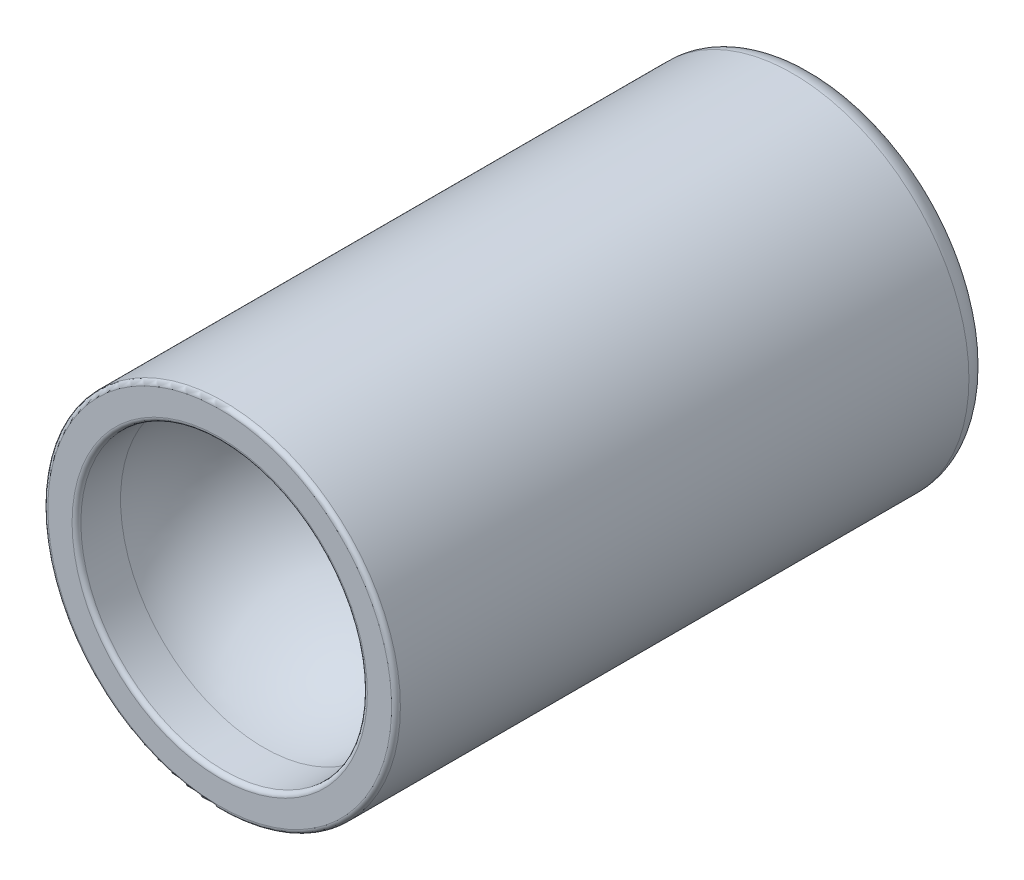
from build123d import *

# Parameters (mm, degrees)
CONG_1_R = 0.2


with BuildPart() as part:
    # Esquisse1 → R_volution1 (revolve)
    with BuildSketch(Plane(origin=(0, 0, 0), x_dir=(0, 0, -1), z_dir=(1, 0, 0)), mode=Mode.PRIVATE) as r_volution1_sk:
        with BuildLine():
            Line((0, 8), (26, 8))
            ThreePointArc((26, 8), (26.707106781, 7.707106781), (27, 7))
            Line((27, 7), (27, 6.5))
            Line((27, 6.5), (21.5, 6.5))
            ThreePointArc((21.5, 6.5), (18.25, 5.629165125), (15.870834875, 3.25))
            Line((15.870834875, 3.25), (7.629165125, 3.25))
            ThreePointArc((7.629165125, 3.25), (5.25, 5.629165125), (2, 6.5))
            Line((2, 6.5), (0, 6.5))
            Line((0, 6.5), (0, 8))
        make_face()
    revolve(r_volution1_sk.sketch.rotate(Axis((0, 0, 0), (0, 0, -1)), 90), axis=Axis((0, 0, 0), (0, 0, -1)))

    # Cong_1
    cong_1_edges = [part.edges().sort_by_distance(p)[0] for p in [
        (-8, 0, 0),
        (-6.5, 0, -27),
        (-3.25, 0, -15.870834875),
        (-3.25, 0, -7.629165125),
        (-6.5, 0, 0),
    ]]
    fillet(cong_1_edges, radius=CONG_1_R)


solid = part.part
